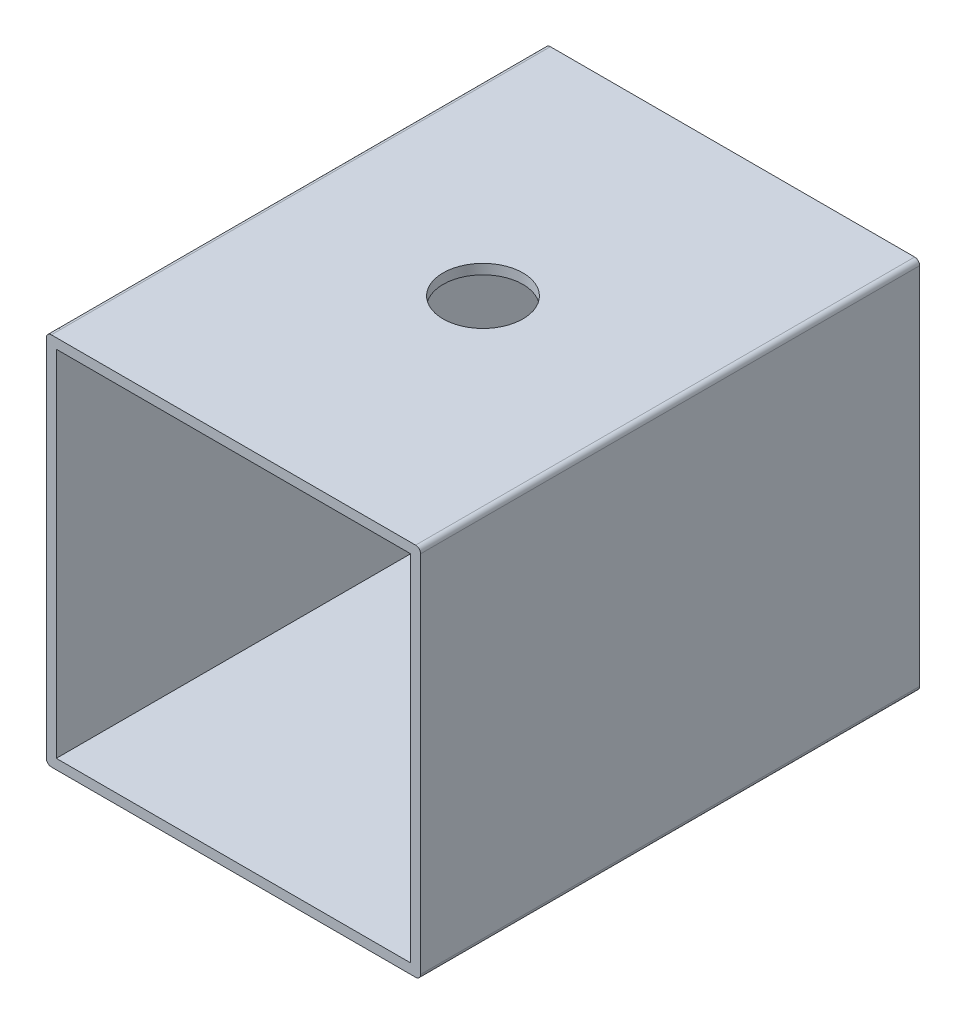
from build123d import *

# Parameters (mm, degrees)
ESQUISSE1_W             = 142
ESQUISSE1_H             = 142
BOSS_EXTRU_1_DEPTH      = 200
ESQUISSE2_R             = 16
ENL_V_MAT_EXTRU_1_DEPTH = 10


with BuildPart() as part:
    # Esquisse1 → Boss.-Extru.1 (new body)
    with BuildSketch(Plane.XY):
        with BuildLine():
            Line((2, 0), (148, 0))
            ThreePointArc((148, 0), (149.414213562, 0.585786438), (150, 2))
            Line((150, 2), (150, 148))
            ThreePointArc((150, 148), (149.414213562, 149.414213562), (148, 150))
            Line((148, 150), (2, 150))
            ThreePointArc((2, 150), (0.585786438, 149.414213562), (0, 148))
            Line((0, 148), (0, 2))
            ThreePointArc((0, 2), (0.585786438, 0.585786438), (2, 0))
        make_face()
        with Locations((75, 75)):
            Rectangle(ESQUISSE1_W, ESQUISSE1_H, mode=Mode.SUBTRACT)
    extrude(amount=BOSS_EXTRU_1_DEPTH)

    # Esquisse2 → Enl_v. mat.-Extru.1 (cut)
    with BuildSketch(Plane(origin=(0, 150, 0), x_dir=(1, 0, 0), z_dir=(0, 1, 0))):
        with Locations(Location((75, -100, 0), (0, 0, 180))):
            Circle(ESQUISSE2_R)
    extrude(amount=-ENL_V_MAT_EXTRU_1_DEPTH, mode=Mode.SUBTRACT)


solid = part.part
